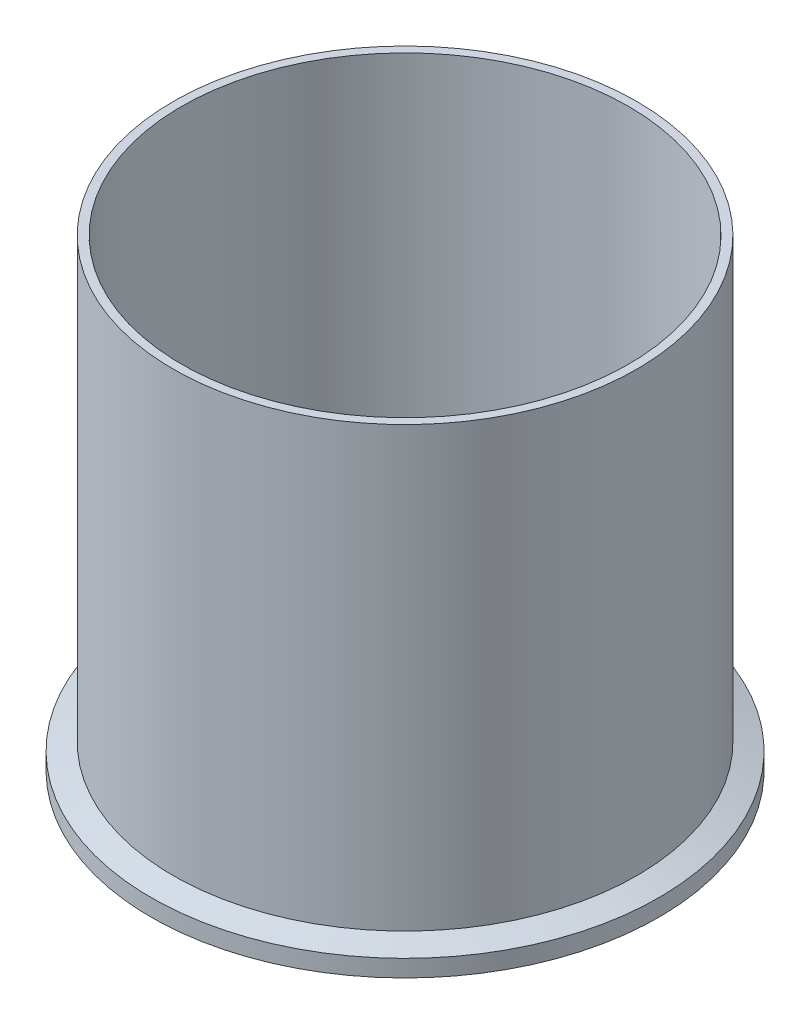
from build123d import *


with BuildPart() as part:
    # Sketch1 → Revolve2 (revolve)
    with BuildSketch(Plane.XY, mode=Mode.PRIVATE) as revolve2_sk:
        with BuildLine():
            Line((-73.4314, 0), (-73.4314, 152.4))
            Line((-73.4314, 152.4), (-76.2, 152.4))
            Line((-76.2, 152.4), (-76.2, 8.222780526))
            Line((-76.2, 8.222780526), (-83.439, 5.588))
            Line((-83.439, 5.588), (-83.439, 0))
            Line((-83.439, 0), (-79.999208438, 0))
            ThreePointArc((-79.999208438, 0), (-79.567011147, 0.129217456), (-79.276666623, 0.474458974))
            ThreePointArc((-79.276666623, 0.474458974), (-78.1812, 1.1938), (-77.085733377, 0.474458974))
            ThreePointArc((-77.085733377, 0.474458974), (-76.795388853, 0.129217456), (-76.363191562, 0))
            Line((-76.363191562, 0), (-73.4314, 0))
        make_face()
    revolve(revolve2_sk.sketch.rotate(Axis((0, 0, 0), (0, 1, 0)), 270), axis=Axis((0, 0, 0), (0, 1, 0)))


solid = part.part
